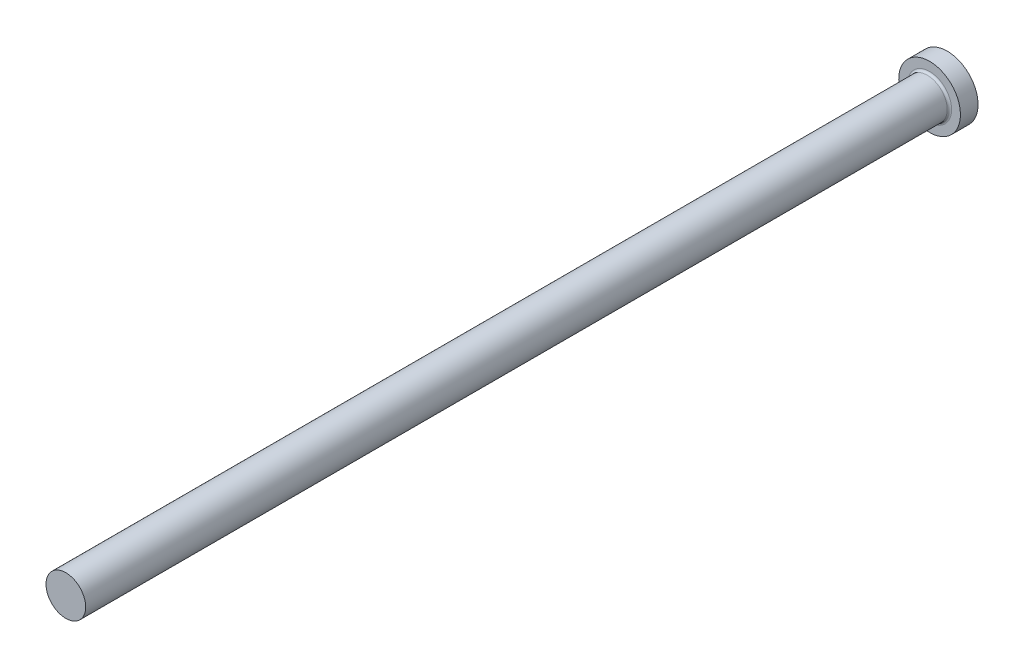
ISO-10303-21;
HEADER;
FILE_DESCRIPTION(('STEP AP214'),'2;1');
FILE_NAME('part.step','',(''),(''),'','','');
FILE_SCHEMA(('AUTOMOTIVE_DESIGN { 1 0 10303 214 1 1 1 1 }'));
ENDSEC;
DATA;
#1=APPLICATION_CONTEXT('core data for automotive mechanical design processes');
#2=APPLICATION_PROTOCOL_DEFINITION('international standard','automotive_design',2000,#1);
#3=PRODUCT_CONTEXT('',#1,'mechanical');
#4=PRODUCT('Part','Part','',(#3));
#5=PRODUCT_RELATED_PRODUCT_CATEGORY('part','',(#4));
#6=PRODUCT_DEFINITION_FORMATION('','',#4);
#7=PRODUCT_DEFINITION_CONTEXT('part definition',#1,'design');
#8=PRODUCT_DEFINITION('design','',#6,#7);
#9=PRODUCT_DEFINITION_SHAPE('','',#8);
#10=(LENGTH_UNIT() NAMED_UNIT(*) SI_UNIT(.MILLI.,.METRE.));
#11=(NAMED_UNIT(*) PLANE_ANGLE_UNIT() SI_UNIT($,.RADIAN.));
#12=(NAMED_UNIT(*) SI_UNIT($,.STERADIAN.) SOLID_ANGLE_UNIT());
#13=UNCERTAINTY_MEASURE_WITH_UNIT(LENGTH_MEASURE(1.E-05),#10,'distance_accuracy_value','');
#14=(GEOMETRIC_REPRESENTATION_CONTEXT(3) GLOBAL_UNCERTAINTY_ASSIGNED_CONTEXT((#13)) GLOBAL_UNIT_ASSIGNED_CONTEXT((#10,
#11,#12)) REPRESENTATION_CONTEXT('',''));
#15=CARTESIAN_POINT('',(0.,0.,0.));
#16=DIRECTION('',(0.,0.,1.));
#17=DIRECTION('',(1.,0.,0.));
#18=AXIS2_PLACEMENT_3D('',#15,#16,#17);
#19=CARTESIAN_POINT('',(7.,0.,4.));
#20=DIRECTION('',(0.,0.,-1.));
#21=DIRECTION('',(-1.,0.,0.));
#22=AXIS2_PLACEMENT_3D('',#19,#20,#21);
#23=PLANE('',#22);
#24=CARTESIAN_POINT('',(0.,0.,4.));
#25=DIRECTION('',(0.,0.,-1.));
#26=DIRECTION('',(-1.,0.,0.));
#27=AXIS2_PLACEMENT_3D('',#24,#25,#26);
#28=CIRCLE('',#27,5.00000000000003);
#29=CARTESIAN_POINT('',(-5.00000000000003,0.,4.));
#30=VERTEX_POINT('',#29);
#31=EDGE_CURVE('E40',#30,#30,#28,.T.);
#32=ORIENTED_EDGE('',*,*,#31,.T.);
#33=EDGE_LOOP('',(#32));
#34=FACE_BOUND('',#33,.T.);
#35=CARTESIAN_POINT('',(0.,0.,4.));
#36=DIRECTION('',(0.,0.,-1.));
#37=DIRECTION('',(-1.,0.,0.));
#38=AXIS2_PLACEMENT_3D('',#35,#36,#37);
#39=CIRCLE('',#38,7.);
#40=CARTESIAN_POINT('',(-7.,0.,4.));
#41=VERTEX_POINT('',#40);
#42=EDGE_CURVE('E44',#41,#41,#39,.T.);
#43=ORIENTED_EDGE('',*,*,#42,.F.);
#44=EDGE_LOOP('',(#43));
#45=FACE_BOUND('',#44,.T.);
#46=ADVANCED_FACE('F33',(#34,#45),#23,.F.);
#47=CARTESIAN_POINT('',(0.,0.,-9.03322817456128));
#48=DIRECTION('',(0.,0.,-1.));
#49=DIRECTION('',(-1.,0.,0.));
#50=AXIS2_PLACEMENT_3D('',#47,#48,#49);
#51=CYLINDRICAL_SURFACE('',#50,7.);
#52=CARTESIAN_POINT('',(0.,0.,0.));
#53=DIRECTION('',(0.,0.,-1.));
#54=DIRECTION('',(-1.,0.,0.));
#55=AXIS2_PLACEMENT_3D('',#52,#53,#54);
#56=CIRCLE('',#55,7.);
#57=CARTESIAN_POINT('',(-7.,0.,0.));
#58=VERTEX_POINT('',#57);
#59=EDGE_CURVE('E48',#58,#58,#56,.T.);
#60=ORIENTED_EDGE('',*,*,#59,.F.);
#61=EDGE_LOOP('',(#60));
#62=FACE_BOUND('',#61,.T.);
#63=ORIENTED_EDGE('',*,*,#42,.T.);
#64=EDGE_LOOP('',(#63));
#65=FACE_BOUND('',#64,.T.);
#66=ADVANCED_FACE('F68',(#62,#65),#51,.T.);
#67=CARTESIAN_POINT('',(0.,0.,0.));
#68=DIRECTION('',(0.,0.,1.));
#69=DIRECTION('',(1.,0.,0.));
#70=AXIS2_PLACEMENT_3D('',#67,#68,#69);
#71=PLANE('',#70);
#72=ORIENTED_EDGE('',*,*,#59,.T.);
#73=EDGE_LOOP('',(#72));
#74=FACE_BOUND('',#73,.T.);
#75=ADVANCED_FACE('F61',(#74),#71,.F.);
#76=CARTESIAN_POINT('',(0.,0.,200.));
#77=DIRECTION('',(0.,0.,-1.));
#78=DIRECTION('',(-1.,0.,0.));
#79=AXIS2_PLACEMENT_3D('',#76,#77,#78);
#80=PLANE('',#79);
#81=CARTESIAN_POINT('',(0.,0.,200.));
#82=DIRECTION('',(0.,0.,-1.));
#83=DIRECTION('',(-1.,0.,0.));
#84=AXIS2_PLACEMENT_3D('',#81,#82,#83);
#85=CIRCLE('',#84,4.50000000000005);
#86=CARTESIAN_POINT('',(-4.50000000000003,0.,200.));
#87=VERTEX_POINT('',#86);
#88=EDGE_CURVE('E53',#87,#87,#85,.T.);
#89=ORIENTED_EDGE('',*,*,#88,.F.);
#90=EDGE_LOOP('',(#89));
#91=FACE_BOUND('',#90,.T.);
#92=ADVANCED_FACE('F59',(#91),#80,.F.);
#93=CARTESIAN_POINT('',(0.,0.,-9.03322817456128));
#94=DIRECTION('',(0.,0.,-1.));
#95=DIRECTION('',(-1.,0.,0.));
#96=AXIS2_PLACEMENT_3D('',#93,#94,#95);
#97=CYLINDRICAL_SURFACE('',#96,4.50000000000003);
#98=CARTESIAN_POINT('',(0.,0.,4.5));
#99=DIRECTION('',(0.,0.,-1.));
#100=DIRECTION('',(-1.,0.,0.));
#101=AXIS2_PLACEMENT_3D('',#98,#99,#100);
#102=CIRCLE('',#101,4.50000000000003);
#103=CARTESIAN_POINT('',(-4.50000000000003,0.,4.5));
#104=VERTEX_POINT('',#103);
#105=EDGE_CURVE('E10',#104,#104,#102,.F.);
#106=ORIENTED_EDGE('',*,*,#105,.T.);
#107=EDGE_LOOP('',(#106));
#108=FACE_BOUND('',#107,.T.);
#109=ORIENTED_EDGE('',*,*,#88,.T.);
#110=EDGE_LOOP('',(#109));
#111=FACE_BOUND('',#110,.T.);
#112=ADVANCED_FACE('F57',(#108,#111),#97,.T.);
#113=CARTESIAN_POINT('',(0.,0.,4.5));
#114=DIRECTION('',(0.,0.,-1.));
#115=DIRECTION('',(-1.,0.,0.));
#116=AXIS2_PLACEMENT_3D('',#113,#114,#115);
#117=TOROIDAL_SURFACE('',#116,5.00000000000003,0.5);
#118=ORIENTED_EDGE('',*,*,#105,.F.);
#119=EDGE_LOOP('',(#118));
#120=FACE_BOUND('',#119,.T.);
#121=ORIENTED_EDGE('',*,*,#31,.F.);
#122=EDGE_LOOP('',(#121));
#123=FACE_BOUND('',#122,.T.);
#124=ADVANCED_FACE('F35',(#120,#123),#117,.F.);
#125=CLOSED_SHELL('',(#46,#66,#75,#92,#112,#124));
#126=MANIFOLD_SOLID_BREP('B2',#125);
#127=ADVANCED_BREP_SHAPE_REPRESENTATION('',(#18,#126),#14);
#128=SHAPE_DEFINITION_REPRESENTATION(#9,#127);
ENDSEC;
END-ISO-10303-21;
